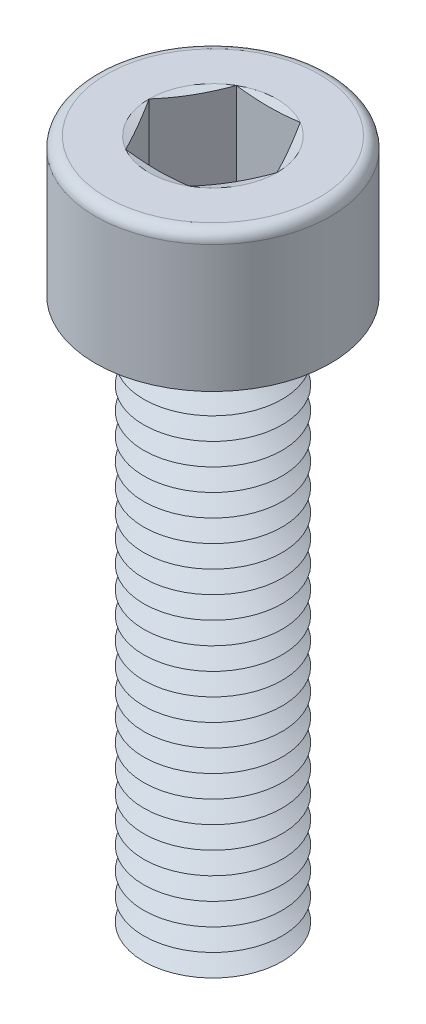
from build123d import *

# Parameters (mm, degrees)
SKETCH1_R       = 2.5
EXTRUDE1_DEPTH  = 20
SKETCH2_R       = 4.25
EXTRUDE2_DEPTH  = 5
EXTRUDE3_DEPTH  = 4
FILLET1_R       = 0.4
LPATTERN1_COUNT = 25
LPATTERN1_PITCH = 0.8


with BuildPart() as part:
    # Sketch1 → Extrude1 (new body)
    with BuildSketch(Plane(origin=(0, 0, 0), x_dir=(1, 0, 0), z_dir=(0, 1, 0))):
        with Locations(Location((0, 0, 0), (0, 0, 270))):
            Circle(SKETCH1_R)
    extrude(amount=EXTRUDE1_DEPTH)

    # Sketch2 → Extrude2 (add)
    with BuildSketch(Plane(origin=(0, 20, 0), x_dir=(1, 0, 0), z_dir=(0, 1, 0))):
        with Locations(Location((0, 0, 0), (0, 0, 270))):
            Circle(SKETCH2_R)
    extrude(amount=EXTRUDE2_DEPTH)

    # Sketch3 → Extrude3 (cut)
    with BuildSketch(Plane(origin=(0, 25, 0), x_dir=(1, 0, 0), z_dir=(0, 1, 0))):
        Polygon((1.154700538, 2), (-1.154700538, 2), (-2.309401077, 0), (-1.154700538, -2), (1.154700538, -2), (2.309401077, 0), align=None)
    extrude(amount=-EXTRUDE3_DEPTH, mode=Mode.SUBTRACT)

    # Fillet1
    fillet1_edges = [part.edges().sort_by_distance(p)[0] for p in [
        (0, 25, -4.25),
    ]]
    fillet(fillet1_edges, radius=FILLET1_R)

    # Sketch4 → Cut-Revolve1 (revolve, cut)
    with BuildSketch(Plane(origin=(0, 0, 0), x_dir=(0, 0, -1), z_dir=(1, 0, 0))):
        Polygon((-2, 21), (0, 21), (0, 19.845299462), align=None)
    revolve(axis=Axis((0, 21, 0), (0, -1, 0)), mode=Mode.SUBTRACT)

    # Sketch5 → Cut-Revolve2 (revolve, cut)
    with BuildSketch(Plane.XY, mode=Mode.PRIVATE) as cut_revolve2_sk:
        Polygon((-2.5, 0.4), (-2.5, -0.4), (-1.807179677, 0), align=None)
    cut_revolve2 = revolve(cut_revolve2_sk.sketch.rotate(Axis((0, 20, 0), (0, -1, 0)), 270), axis=Axis((0, 20, 0), (0, -1, 0)), mode=Mode.SUBTRACT)

    # LPattern1: Cut-Revolve2 ×25
    with Locations(*[(0, i * LPATTERN1_PITCH, 0) for i in range(1, LPATTERN1_COUNT)]):
        add(cut_revolve2, mode=Mode.SUBTRACT)

    # Extrude4 cone 1 section (on through the dimple's axis) → Extrude4 (revolve, cut)
    with BuildSketch(Plane(origin=(0, 25, 0), x_dir=(0, 0, 1), z_dir=(1, 0, 0))):
        Polygon((0, 0), (2.309401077, 0), (0, 0.618802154), align=None)
    revolve(axis=Axis((0, 25, 0), (0, -1, 0)), mode=Mode.SUBTRACT)


solid = part.part
